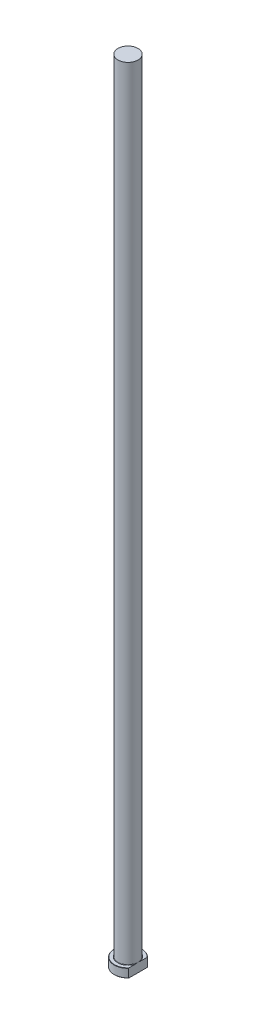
ISO-10303-21;
HEADER;
FILE_DESCRIPTION(('STEP AP214'),'2;1');
FILE_NAME('part.step','',(''),(''),'','','');
FILE_SCHEMA(('AUTOMOTIVE_DESIGN { 1 0 10303 214 1 1 1 1 }'));
ENDSEC;
DATA;
#1=APPLICATION_CONTEXT('core data for automotive mechanical design processes');
#2=APPLICATION_PROTOCOL_DEFINITION('international standard','automotive_design',2000,#1);
#3=PRODUCT_CONTEXT('',#1,'mechanical');
#4=PRODUCT('Part','Part','',(#3));
#5=PRODUCT_RELATED_PRODUCT_CATEGORY('part','',(#4));
#6=PRODUCT_DEFINITION_FORMATION('','',#4);
#7=PRODUCT_DEFINITION_CONTEXT('part definition',#1,'design');
#8=PRODUCT_DEFINITION('design','',#6,#7);
#9=PRODUCT_DEFINITION_SHAPE('','',#8);
#10=(LENGTH_UNIT() NAMED_UNIT(*) SI_UNIT(.MILLI.,.METRE.));
#11=(NAMED_UNIT(*) PLANE_ANGLE_UNIT() SI_UNIT($,.RADIAN.));
#12=(NAMED_UNIT(*) SI_UNIT($,.STERADIAN.) SOLID_ANGLE_UNIT());
#13=UNCERTAINTY_MEASURE_WITH_UNIT(LENGTH_MEASURE(1.E-05),#10,'distance_accuracy_value','');
#14=(GEOMETRIC_REPRESENTATION_CONTEXT(3) GLOBAL_UNCERTAINTY_ASSIGNED_CONTEXT((#13)) GLOBAL_UNIT_ASSIGNED_CONTEXT((#10,
#11,#12)) REPRESENTATION_CONTEXT('',''));
#15=CARTESIAN_POINT('',(0.,0.,0.));
#16=DIRECTION('',(0.,0.,1.));
#17=DIRECTION('',(1.,0.,0.));
#18=AXIS2_PLACEMENT_3D('',#15,#16,#17);
#19=CARTESIAN_POINT('',(0.,0.,0.));
#20=DIRECTION('',(0.,-1.,0.));
#21=DIRECTION('',(0.,0.,-1.));
#22=AXIS2_PLACEMENT_3D('',#19,#20,#21);
#23=PLANE('',#22);
#24=CARTESIAN_POINT('',(0.,0.,0.));
#25=DIRECTION('',(0.,-1.,0.));
#26=DIRECTION('',(0.,0.,-1.));
#27=AXIS2_PLACEMENT_3D('',#24,#25,#26);
#28=CIRCLE('',#27,10.8);
#29=CARTESIAN_POINT('',(7.99999999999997,0.,7.25534285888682));
#30=VERTEX_POINT('',#29);
#31=CARTESIAN_POINT('',(7.99999999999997,0.,-7.25534285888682));
#32=VERTEX_POINT('',#31);
#33=EDGE_CURVE('E98',#30,#32,#28,.T.);
#34=ORIENTED_EDGE('',*,*,#33,.T.);
#35=DIRECTION('',(0.,0.,1.));
#36=VECTOR('',#35,1.);
#37=CARTESIAN_POINT('',(7.99999999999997,0.,-7.54983443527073));
#38=LINE('',#37,#36);
#39=EDGE_CURVE('E83',#32,#30,#38,.T.);
#40=ORIENTED_EDGE('',*,*,#39,.T.);
#41=EDGE_LOOP('',(#34,#40));
#42=FACE_BOUND('',#41,.T.);
#43=ADVANCED_FACE('F32',(#42),#23,.T.);
#44=CARTESIAN_POINT('',(0.,259.958771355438,0.));
#45=DIRECTION('',(0.,1.,0.));
#46=DIRECTION('',(0.,0.,1.));
#47=AXIS2_PLACEMENT_3D('',#44,#45,#46);
#48=CYLINDRICAL_SURFACE('',#47,11.);
#49=CARTESIAN_POINT('',(0.,6.80000000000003,0.));
#50=DIRECTION('',(0.,1.,0.));
#51=DIRECTION('',(0.,0.,1.));
#52=AXIS2_PLACEMENT_3D('',#49,#50,#51);
#53=CIRCLE('',#52,11.);
#54=CARTESIAN_POINT('',(7.99999999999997,6.80000000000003,7.54983443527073));
#55=VERTEX_POINT('',#54);
#56=CARTESIAN_POINT('',(7.99999999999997,6.80000000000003,-7.54983443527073));
#57=VERTEX_POINT('',#56);
#58=EDGE_CURVE('E104',#55,#57,#53,.F.);
#59=ORIENTED_EDGE('',*,*,#58,.T.);
#60=DIRECTION('',(0.,-1.,0.));
#61=VECTOR('',#60,1.);
#62=CARTESIAN_POINT('',(7.99999999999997,630.,-7.54983443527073));
#63=LINE('',#62,#61);
#64=CARTESIAN_POINT('',(7.99999999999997,0.200000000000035,-7.54983443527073));
#65=VERTEX_POINT('',#64);
#66=EDGE_CURVE('E183',#57,#65,#63,.T.);
#67=ORIENTED_EDGE('',*,*,#66,.T.);
#68=CARTESIAN_POINT('',(0.,0.200000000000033,0.));
#69=DIRECTION('',(0.,-1.,0.));
#70=DIRECTION('',(0.,0.,-1.));
#71=AXIS2_PLACEMENT_3D('',#68,#69,#70);
#72=CIRCLE('',#71,11.);
#73=CARTESIAN_POINT('',(7.99999999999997,0.200000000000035,7.54983443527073));
#74=VERTEX_POINT('',#73);
#75=EDGE_CURVE('E100',#65,#74,#72,.F.);
#76=ORIENTED_EDGE('',*,*,#75,.T.);
#77=DIRECTION('',(0.,-1.,0.));
#78=VECTOR('',#77,1.);
#79=CARTESIAN_POINT('',(7.99999999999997,630.,7.54983443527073));
#80=LINE('',#79,#78);
#81=EDGE_CURVE('E93',#55,#74,#80,.T.);
#82=ORIENTED_EDGE('',*,*,#81,.F.);
#83=EDGE_LOOP('',(#59,#67,#76,#82));
#84=FACE_BOUND('',#83,.T.);
#85=ADVANCED_FACE('F158',(#84),#48,.T.);
#86=CARTESIAN_POINT('',(-11.,7.,0.));
#87=DIRECTION('',(0.,1.,0.));
#88=DIRECTION('',(0.,0.,1.));
#89=AXIS2_PLACEMENT_3D('',#86,#87,#88);
#90=PLANE('',#89);
#91=CARTESIAN_POINT('',(0.,7.,0.));
#92=DIRECTION('',(0.,1.,0.));
#93=DIRECTION('',(0.,0.,1.));
#94=AXIS2_PLACEMENT_3D('',#91,#92,#93);
#95=CIRCLE('',#94,10.8);
#96=CARTESIAN_POINT('',(7.99999999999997,7.,-7.25534285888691));
#97=VERTEX_POINT('',#96);
#98=CARTESIAN_POINT('',(7.99999999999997,7.,7.25534285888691));
#99=VERTEX_POINT('',#98);
#100=EDGE_CURVE('E178',#97,#99,#95,.T.);
#101=ORIENTED_EDGE('',*,*,#100,.T.);
#102=DIRECTION('',(0.,0.,-1.));
#103=VECTOR('',#102,1.);
#104=CARTESIAN_POINT('',(7.99999999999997,7.,0.));
#105=LINE('',#104,#103);
#106=CARTESIAN_POINT('',(7.99999999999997,6.99999999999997,2.21133443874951));
#107=VERTEX_POINT('',#106);
#108=EDGE_CURVE('E57',#99,#107,#105,.T.);
#109=ORIENTED_EDGE('',*,*,#108,.T.);
#110=CARTESIAN_POINT('',(0.,7.,0.));
#111=DIRECTION('',(0.,1.,0.));
#112=DIRECTION('',(0.,0.,1.));
#113=AXIS2_PLACEMENT_3D('',#110,#111,#112);
#114=CIRCLE('',#113,8.29999999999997);
#115=CARTESIAN_POINT('',(7.99999999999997,6.99999999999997,-2.21133443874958));
#116=VERTEX_POINT('',#115);
#117=EDGE_CURVE('E107',#107,#116,#114,.F.);
#118=ORIENTED_EDGE('',*,*,#117,.T.);
#119=EDGE_CURVE('E136',#116,#97,#105,.T.);
#120=ORIENTED_EDGE('',*,*,#119,.T.);
#121=EDGE_LOOP('',(#101,#109,#118,#120));
#122=FACE_BOUND('',#121,.T.);
#123=ADVANCED_FACE('F147',(#122),#90,.T.);
#124=CARTESIAN_POINT('',(0.,7.00000000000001,0.));
#125=DIRECTION('',(0.,-1.,0.));
#126=DIRECTION('',(0.,0.,-1.));
#127=AXIS2_PLACEMENT_3D('',#124,#125,#126);
#128=CONICAL_SURFACE('',#127,10.8,0.785398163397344);
#129=ORIENTED_EDGE('',*,*,#58,.F.);
#130=CARTESIAN_POINT('',(7.99999999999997,-0.636730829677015,16.6106304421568));
#131=CARTESIAN_POINT('',(7.99999999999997,-0.418611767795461,16.3685283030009));
#132=CARTESIAN_POINT('',(7.99999999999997,-0.200984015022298,16.1259843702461));
#133=CARTESIAN_POINT('',(7.99999999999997,0.233148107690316,15.639892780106));
#134=CARTESIAN_POINT('',(7.99999999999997,0.449652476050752,15.3963451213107));
#135=CARTESIAN_POINT('',(7.99999999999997,1.09739989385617,14.6638687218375));
#136=CARTESIAN_POINT('',(7.99999999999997,1.52674426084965,14.1732538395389));
#137=CARTESIAN_POINT('',(7.99999999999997,2.16792810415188,13.430465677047));
#138=CARTESIAN_POINT('',(7.99999999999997,2.38226067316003,13.1804430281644));
#139=CARTESIAN_POINT('',(7.99999999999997,2.80892954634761,12.6787083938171));
#140=CARTESIAN_POINT('',(7.99999999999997,3.02126589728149,12.4269964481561));
#141=CARTESIAN_POINT('',(7.99999999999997,3.44357020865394,11.921674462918));
#142=CARTESIAN_POINT('',(7.99999999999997,3.6535386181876,11.6680647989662));
#143=CARTESIAN_POINT('',(7.99999999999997,4.07074862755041,11.1585723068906));
#144=CARTESIAN_POINT('',(7.99999999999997,4.27798998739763,10.9026892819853));
#145=CARTESIAN_POINT('',(7.99999999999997,4.66965190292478,10.4127607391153));
#146=CARTESIAN_POINT('',(7.99999999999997,4.8543686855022,10.178952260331));
#147=CARTESIAN_POINT('',(7.99999999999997,5.22063517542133,9.70886883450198));
#148=CARTESIAN_POINT('',(7.99999999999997,5.40218492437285,9.4725939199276));
#149=CARTESIAN_POINT('',(7.99999999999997,5.76149237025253,8.99721569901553));
#150=CARTESIAN_POINT('',(7.99999999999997,5.93925050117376,8.75811272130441));
#151=CARTESIAN_POINT('',(7.99999999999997,6.29022306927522,8.27660199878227));
#152=CARTESIAN_POINT('',(7.99999999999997,6.46343768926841,8.03419438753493));
#153=CARTESIAN_POINT('',(7.99999999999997,6.80398487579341,7.54604999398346));
#154=CARTESIAN_POINT('',(7.99999999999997,6.97132935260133,7.30032154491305));
#155=CARTESIAN_POINT('',(7.99999999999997,7.29928849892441,6.8043777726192));
#156=CARTESIAN_POINT('',(7.99999999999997,7.4599028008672,6.55416220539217));
#157=CARTESIAN_POINT('',(7.99999999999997,7.77264940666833,6.0487314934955));
#158=CARTESIAN_POINT('',(7.99999999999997,7.92478824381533,5.79352041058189));
#159=CARTESIAN_POINT('',(7.99999999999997,8.21859570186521,5.27715744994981));
#160=CARTESIAN_POINT('',(7.99999999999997,8.36026610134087,5.0160065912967));
#161=CARTESIAN_POINT('',(7.99999999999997,8.62213596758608,4.50319242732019));
#162=CARTESIAN_POINT('',(7.99999999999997,8.74311989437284,4.25193242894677));
#163=CARTESIAN_POINT('',(7.99999999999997,8.97065709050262,3.74287674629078));
#164=CARTESIAN_POINT('',(7.99999999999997,9.07720941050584,3.48508063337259));
#165=CARTESIAN_POINT('',(7.99999999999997,9.27220860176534,2.96337495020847));
#166=CARTESIAN_POINT('',(7.99999999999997,9.36069936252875,2.6994819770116));
#167=CARTESIAN_POINT('',(7.99999999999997,9.5160431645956,2.165427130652));
#168=CARTESIAN_POINT('',(7.99999999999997,9.58290677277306,1.89526838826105));
#169=CARTESIAN_POINT('',(7.99999999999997,9.68291221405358,1.39216000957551));
#170=CARTESIAN_POINT('',(7.99999999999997,9.71967474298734,1.15993430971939));
#171=CARTESIAN_POINT('',(7.99999999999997,9.77336730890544,0.693196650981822));
#172=CARTESIAN_POINT('',(7.99999999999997,9.79030037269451,0.45868504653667));
#173=CARTESIAN_POINT('',(7.99999999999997,9.80342851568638,-0.0106727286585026));
#174=CARTESIAN_POINT('',(7.99999999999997,9.7996460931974,-0.245518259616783));
#175=CARTESIAN_POINT('',(7.99999999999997,9.77160926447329,-0.713989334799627));
#176=CARTESIAN_POINT('',(7.99999999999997,9.74735189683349,-0.947614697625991));
#177=CARTESIAN_POINT('',(7.99999999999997,9.67070830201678,-1.47287443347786));
#178=CARTESIAN_POINT('',(7.99999999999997,9.61261890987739,-1.76367634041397));
#179=CARTESIAN_POINT('',(7.99999999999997,9.46982192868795,-2.33873282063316));
#180=CARTESIAN_POINT('',(7.99999999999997,9.3850975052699,-2.622983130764));
#181=CARTESIAN_POINT('',(7.99999999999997,9.24134311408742,-3.04436856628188));
#182=CARTESIAN_POINT('',(7.99999999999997,9.19048552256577,-3.18437323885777));
#183=CARTESIAN_POINT('',(7.99999999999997,9.08381674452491,-3.46241560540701));
#184=CARTESIAN_POINT('',(7.99999999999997,9.0280078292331,-3.60045416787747));
#185=CARTESIAN_POINT('',(7.99999999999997,8.91195481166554,-3.87463242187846));
#186=CARTESIAN_POINT('',(7.99999999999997,8.85171106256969,-4.01077226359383));
#187=CARTESIAN_POINT('',(7.99999999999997,8.72725899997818,-4.28124317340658));
#188=CARTESIAN_POINT('',(7.99999999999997,8.66305017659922,-4.41557400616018));
#189=CARTESIAN_POINT('',(7.99999999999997,8.48984738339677,-4.76597692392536));
#190=CARTESIAN_POINT('',(7.99999999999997,8.37796178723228,-4.98062176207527));
#191=CARTESIAN_POINT('',(7.99999999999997,8.14649205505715,-5.40573762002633));
#192=CARTESIAN_POINT('',(7.99999999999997,8.02690659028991,-5.61620791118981));
#193=CARTESIAN_POINT('',(7.99999999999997,7.78128707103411,-6.03349586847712));
#194=CARTESIAN_POINT('',(7.99999999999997,7.6552494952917,-6.24031145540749));
#195=CARTESIAN_POINT('',(7.99999999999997,7.39783636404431,-6.65060320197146));
#196=CARTESIAN_POINT('',(7.99999999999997,7.26646042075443,-6.85407911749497));
#197=CARTESIAN_POINT('',(7.99999999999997,6.99890352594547,-7.25856399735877));
#198=CARTESIAN_POINT('',(7.99999999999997,6.86271149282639,-7.45956561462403));
#199=CARTESIAN_POINT('',(7.99999999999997,6.58651908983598,-7.85893907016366));
#200=CARTESIAN_POINT('',(7.99999999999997,6.44651858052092,-8.05731081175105));
#201=CARTESIAN_POINT('',(7.99999999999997,6.02178241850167,-8.64881247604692));
#202=CARTESIAN_POINT('',(7.99999999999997,5.73221467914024,-9.03847436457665));
#203=CARTESIAN_POINT('',(7.99999999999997,5.14234581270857,-9.8121850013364));
#204=CARTESIAN_POINT('',(7.99999999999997,4.84200393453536,-10.1962024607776));
#205=CARTESIAN_POINT('',(7.99999999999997,4.23404813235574,-10.9584616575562));
#206=CARTESIAN_POINT('',(7.99999999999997,3.92643376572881,-11.3367030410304));
#207=CARTESIAN_POINT('',(7.99999999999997,3.30600745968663,-12.0880358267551));
#208=CARTESIAN_POINT('',(7.99999999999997,2.9932030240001,-12.4611334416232));
#209=CARTESIAN_POINT('',(7.99999999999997,2.36317801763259,-13.2035599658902));
#210=CARTESIAN_POINT('',(7.99999999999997,2.04595754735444,-13.5728889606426));
#211=CARTESIAN_POINT('',(7.99999999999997,1.33644011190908,-14.3909378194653));
#212=CARTESIAN_POINT('',(7.99999999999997,0.943258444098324,-14.8388897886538));
#213=CARTESIAN_POINT('',(7.99999999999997,0.351483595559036,-15.506812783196));
#214=CARTESIAN_POINT('',(7.99999999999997,0.154449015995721,-15.7281687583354));
#215=CARTESIAN_POINT('',(7.99999999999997,-0.240498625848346,-16.1700151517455));
#216=CARTESIAN_POINT('',(7.99999999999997,-0.438411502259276,-16.3905057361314));
#217=CARTESIAN_POINT('',(7.99999999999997,-0.636730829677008,-16.6106304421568));
#218=B_SPLINE_CURVE_WITH_KNOTS('',3,(#130,#131,#132,#133,#134,#135,#136,#137,#138,#139,#140,
#141,#142,#143,#144,#145,#146,#147,#148,#149,#150,#151,#152,#153,#154,#155,#156,#157,#158,#159,
#160,#161,#162,#163,#164,#165,#166,#167,#168,#169,#170,#171,#172,#173,#174,#175,#176,#177,#178,
#179,#180,#181,#182,#183,#184,#185,#186,#187,#188,#189,#190,#191,#192,#193,#194,#195,#196,#197,
#198,#199,#200,#201,#202,#203,#204,#205,#206,#207,#208,#209,#210,#211,#212,#213,#214,#215,#216,
#217),.UNSPECIFIED.,.F.,.F.,(4,2,2,2,2,2,2,2,2,2,2,2,2,2,2,2,2,2,2,2,2,2,2,2,2,2,2,2,2,2,2,2,2,
2,2,2,2,2,2,2,2,2,2,4),(0.,0.977598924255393,1.9551992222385,3.91099512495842,4.8989385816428,
5.88685884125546,6.87458847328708,7.86240445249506,8.75629469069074,9.65017317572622,
10.5439487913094,11.4376883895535,12.3294952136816,13.2213506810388,14.112508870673,
15.0035153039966,15.839762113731,16.6760639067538,17.5103086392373,18.3441451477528,
19.0487229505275,19.7531931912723,20.4568984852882,21.1607055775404,22.0488428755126,
22.9375426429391,23.3843335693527,23.8309205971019,24.2774720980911,24.7240811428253,
25.4500411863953,26.1761268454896,26.9026130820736,27.6291521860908,28.3574884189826,
29.0858513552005,30.542052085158,32.0045059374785,33.467049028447,34.927635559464,
36.3881889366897,38.1762452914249,39.0652821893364,39.9541391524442),.UNSPECIFIED.);
#219=EDGE_CURVE('E135',#55,#99,#218,.T.);
#220=ORIENTED_EDGE('',*,*,#219,.T.);
#221=ORIENTED_EDGE('',*,*,#100,.F.);
#222=EDGE_CURVE('E127',#97,#57,#218,.T.);
#223=ORIENTED_EDGE('',*,*,#222,.T.);
#224=EDGE_LOOP('',(#129,#220,#221,#223));
#225=FACE_BOUND('',#224,.T.);
#226=ADVANCED_FACE('F143',(#225),#128,.T.);
#227=CARTESIAN_POINT('',(0.,0.200000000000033,0.));
#228=DIRECTION('',(0.,1.,0.));
#229=DIRECTION('',(0.,0.,1.));
#230=AXIS2_PLACEMENT_3D('',#227,#228,#229);
#231=CONICAL_SURFACE('',#230,11.,0.785398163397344);
#232=ORIENTED_EDGE('',*,*,#75,.F.);
#233=CARTESIAN_POINT('',(7.99999999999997,7.63673082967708,-16.6106304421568));
#234=CARTESIAN_POINT('',(7.99999999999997,7.41861176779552,-16.3685283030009));
#235=CARTESIAN_POINT('',(7.99999999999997,7.20098401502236,-16.1259843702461));
#236=CARTESIAN_POINT('',(7.99999999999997,6.76685189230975,-15.639892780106));
#237=CARTESIAN_POINT('',(7.99999999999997,6.55034752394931,-15.3963451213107));
#238=CARTESIAN_POINT('',(7.99999999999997,5.90260010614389,-14.6638687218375));
#239=CARTESIAN_POINT('',(7.99999999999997,5.47325573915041,-14.1732538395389));
#240=CARTESIAN_POINT('',(7.99999999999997,4.83207189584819,-13.430465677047));
#241=CARTESIAN_POINT('',(7.99999999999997,4.61773932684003,-13.1804430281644));
#242=CARTESIAN_POINT('',(7.99999999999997,4.19107045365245,-12.6787083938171));
#243=CARTESIAN_POINT('',(7.99999999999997,3.97873410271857,-12.4269964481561));
#244=CARTESIAN_POINT('',(7.99999999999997,3.55642979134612,-11.921674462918));
#245=CARTESIAN_POINT('',(7.99999999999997,3.34646138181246,-11.6680647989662));
#246=CARTESIAN_POINT('',(7.99999999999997,2.92925137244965,-11.1585723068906));
#247=CARTESIAN_POINT('',(7.99999999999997,2.72201001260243,-10.9026892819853));
#248=CARTESIAN_POINT('',(7.99999999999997,2.33034809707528,-10.4127607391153));
#249=CARTESIAN_POINT('',(7.99999999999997,2.14563131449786,-10.178952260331));
#250=CARTESIAN_POINT('',(7.99999999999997,1.77936482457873,-9.70886883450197));
#251=CARTESIAN_POINT('',(7.99999999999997,1.59781507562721,-9.4725939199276));
#252=CARTESIAN_POINT('',(7.99999999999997,1.23850762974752,-8.99721569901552));
#253=CARTESIAN_POINT('',(7.99999999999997,1.0607494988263,-8.75811272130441));
#254=CARTESIAN_POINT('',(7.99999999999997,0.709776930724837,-8.27660199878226));
#255=CARTESIAN_POINT('',(7.99999999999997,0.536562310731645,-8.03419438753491));
#256=CARTESIAN_POINT('',(7.99999999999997,0.196015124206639,-7.54604999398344));
#257=CARTESIAN_POINT('',(7.99999999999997,0.0286706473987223,-7.30032154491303));
#258=CARTESIAN_POINT('',(7.99999999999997,-0.299288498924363,-6.80437777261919));
#259=CARTESIAN_POINT('',(7.99999999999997,-0.459902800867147,-6.55416220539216));
#260=CARTESIAN_POINT('',(7.99999999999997,-0.772649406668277,-6.04873149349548));
#261=CARTESIAN_POINT('',(7.99999999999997,-0.924788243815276,-5.79352041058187));
#262=CARTESIAN_POINT('',(7.99999999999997,-1.21859570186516,-5.27715744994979));
#263=CARTESIAN_POINT('',(7.99999999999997,-1.36026610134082,-5.01600659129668));
#264=CARTESIAN_POINT('',(7.99999999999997,-1.62213596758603,-4.50319242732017));
#265=CARTESIAN_POINT('',(7.99999999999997,-1.74311989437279,-4.25193242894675));
#266=CARTESIAN_POINT('',(7.99999999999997,-1.97065709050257,-3.74287674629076));
#267=CARTESIAN_POINT('',(7.99999999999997,-2.07720941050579,-3.48508063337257));
#268=CARTESIAN_POINT('',(7.99999999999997,-2.27220860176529,-2.96337495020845));
#269=CARTESIAN_POINT('',(7.99999999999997,-2.36069936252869,-2.69948197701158));
#270=CARTESIAN_POINT('',(7.99999999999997,-2.51604316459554,-2.16542713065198));
#271=CARTESIAN_POINT('',(7.99999999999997,-2.582906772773,-1.89526838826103));
#272=CARTESIAN_POINT('',(7.99999999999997,-2.68291221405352,-1.39216000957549));
#273=CARTESIAN_POINT('',(7.99999999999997,-2.71967474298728,-1.15993430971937));
#274=CARTESIAN_POINT('',(7.99999999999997,-2.77336730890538,-0.693196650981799));
#275=CARTESIAN_POINT('',(7.99999999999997,-2.79030037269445,-0.458685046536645));
#276=CARTESIAN_POINT('',(7.99999999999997,-2.80342851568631,0.0106727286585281));
#277=CARTESIAN_POINT('',(7.99999999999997,-2.79964609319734,0.245518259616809));
#278=CARTESIAN_POINT('',(7.99999999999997,-2.77160926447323,0.713989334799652));
#279=CARTESIAN_POINT('',(7.99999999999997,-2.74735189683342,0.947614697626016));
#280=CARTESIAN_POINT('',(7.99999999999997,-2.67070830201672,1.47287443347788));
#281=CARTESIAN_POINT('',(7.99999999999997,-2.61261890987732,1.76367634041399));
#282=CARTESIAN_POINT('',(7.99999999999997,-2.46982192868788,2.33873282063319));
#283=CARTESIAN_POINT('',(7.99999999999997,-2.38509750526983,2.62298313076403));
#284=CARTESIAN_POINT('',(7.99999999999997,-2.24134311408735,3.04436856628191));
#285=CARTESIAN_POINT('',(7.99999999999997,-2.1904855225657,3.1843732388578));
#286=CARTESIAN_POINT('',(7.99999999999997,-2.08381674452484,3.46241560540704));
#287=CARTESIAN_POINT('',(7.99999999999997,-2.02800782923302,3.6004541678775));
#288=CARTESIAN_POINT('',(7.99999999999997,-1.91195481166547,3.87463242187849));
#289=CARTESIAN_POINT('',(7.99999999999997,-1.85171106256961,4.01077226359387));
#290=CARTESIAN_POINT('',(7.99999999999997,-1.72725899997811,4.28124317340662));
#291=CARTESIAN_POINT('',(7.99999999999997,-1.66305017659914,4.41557400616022));
#292=CARTESIAN_POINT('',(7.99999999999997,-1.48984738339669,4.7659769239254));
#293=CARTESIAN_POINT('',(7.99999999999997,-1.37796178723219,4.98062176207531));
#294=CARTESIAN_POINT('',(7.99999999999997,-1.14649205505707,5.40573762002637));
#295=CARTESIAN_POINT('',(7.99999999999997,-1.02690659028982,5.61620791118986));
#296=CARTESIAN_POINT('',(7.99999999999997,-0.781287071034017,6.03349586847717));
#297=CARTESIAN_POINT('',(7.99999999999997,-0.655249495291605,6.24031145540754));
#298=CARTESIAN_POINT('',(7.99999999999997,-0.397836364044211,6.65060320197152));
#299=CARTESIAN_POINT('',(7.99999999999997,-0.266460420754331,6.85407911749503));
#300=CARTESIAN_POINT('',(7.99999999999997,0.00109647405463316,7.25856399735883));
#301=CARTESIAN_POINT('',(7.99999999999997,0.137288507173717,7.4595656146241));
#302=CARTESIAN_POINT('',(7.99999999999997,0.413480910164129,7.85893907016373));
#303=CARTESIAN_POINT('',(7.99999999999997,0.553481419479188,8.05731081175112));
#304=CARTESIAN_POINT('',(7.99999999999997,0.978217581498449,8.64881247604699));
#305=CARTESIAN_POINT('',(7.99999999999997,1.26778532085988,9.03847436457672));
#306=CARTESIAN_POINT('',(7.99999999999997,1.85765418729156,9.81218500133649));
#307=CARTESIAN_POINT('',(7.99999999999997,2.15799606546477,10.1962024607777));
#308=CARTESIAN_POINT('',(7.99999999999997,2.7659518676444,10.9584616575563));
#309=CARTESIAN_POINT('',(7.99999999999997,3.07356623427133,11.3367030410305));
#310=CARTESIAN_POINT('',(7.99999999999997,3.69399254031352,12.0880358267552));
#311=CARTESIAN_POINT('',(7.99999999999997,4.00679697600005,12.4611334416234));
#312=CARTESIAN_POINT('',(7.99999999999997,4.63682198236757,13.2035599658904));
#313=CARTESIAN_POINT('',(7.99999999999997,4.95404245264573,13.5728889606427));
#314=CARTESIAN_POINT('',(7.99999999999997,5.66355988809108,14.3909378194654));
#315=CARTESIAN_POINT('',(7.99999999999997,6.05674155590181,14.8388897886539));
#316=CARTESIAN_POINT('',(7.99999999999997,6.64851640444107,15.506812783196));
#317=CARTESIAN_POINT('',(7.99999999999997,6.84555098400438,15.7281687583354));
#318=CARTESIAN_POINT('',(7.99999999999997,7.24049862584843,16.1700151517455));
#319=CARTESIAN_POINT('',(7.99999999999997,7.43841150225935,16.3905057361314));
#320=CARTESIAN_POINT('',(7.99999999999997,7.63673082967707,16.6106304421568));
#321=B_SPLINE_CURVE_WITH_KNOTS('',3,(#233,#234,#235,#236,#237,#238,#239,#240,#241,#242,#243,
#244,#245,#246,#247,#248,#249,#250,#251,#252,#253,#254,#255,#256,#257,#258,#259,#260,#261,#262,
#263,#264,#265,#266,#267,#268,#269,#270,#271,#272,#273,#274,#275,#276,#277,#278,#279,#280,#281,
#282,#283,#284,#285,#286,#287,#288,#289,#290,#291,#292,#293,#294,#295,#296,#297,#298,#299,#300,
#301,#302,#303,#304,#305,#306,#307,#308,#309,#310,#311,#312,#313,#314,#315,#316,#317,#318,#319,
#320),.UNSPECIFIED.,.F.,.F.,(4,2,2,2,2,2,2,2,2,2,2,2,2,2,2,2,2,2,2,2,2,2,2,2,2,2,2,2,2,2,2,2,2,
2,2,2,2,2,2,2,2,2,2,4),(0.,0.977598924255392,1.9551992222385,3.91099512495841,4.8989385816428,
5.88685884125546,6.87458847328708,7.86240445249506,8.75629469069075,9.65017317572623,
10.5439487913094,11.4376883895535,12.3294952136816,13.2213506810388,14.112508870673,
15.0035153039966,15.8397621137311,16.6760639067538,17.5103086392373,18.3441451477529,
19.0487229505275,19.7531931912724,20.4568984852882,21.1607055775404,22.0488428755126,
22.9375426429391,23.3843335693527,23.830920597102,24.2774720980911,24.7240811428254,
25.4500411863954,26.1761268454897,26.9026130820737,27.6291521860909,28.3574884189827,
29.0858513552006,30.5420520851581,32.0045059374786,33.4670490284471,34.9276355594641,
36.3881889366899,38.176245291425,39.0652821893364,39.9541391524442),.UNSPECIFIED.);
#322=EDGE_CURVE('E86',#65,#32,#321,.T.);
#323=ORIENTED_EDGE('',*,*,#322,.T.);
#324=ORIENTED_EDGE('',*,*,#33,.F.);
#325=EDGE_CURVE('E89',#30,#74,#321,.T.);
#326=ORIENTED_EDGE('',*,*,#325,.T.);
#327=EDGE_LOOP('',(#232,#323,#324,#326));
#328=FACE_BOUND('',#327,.T.);
#329=ADVANCED_FACE('F97',(#328),#231,.T.);
#330=CARTESIAN_POINT('',(0.,7.29999999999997,0.));
#331=DIRECTION('',(0.,1.,0.));
#332=DIRECTION('',(0.,0.,1.));
#333=AXIS2_PLACEMENT_3D('',#330,#331,#332);
#334=TOROIDAL_SURFACE('',#333,8.29999999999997,0.3);
#335=CARTESIAN_POINT('',(7.99999999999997,7.29999999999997,0.));
#336=CARTESIAN_POINT('',(7.99999999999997,7.30000062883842,1.41343368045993E-10));
#337=CARTESIAN_POINT('',(7.99999999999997,7.30000125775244,-3.45355322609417E-07));
#338=CARTESIAN_POINT('',(7.99999999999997,7.30000241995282,-1.23398463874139E-06));
#339=CARTESIAN_POINT('',(7.99999999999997,7.30000291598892,-1.80141989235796E-06));
#340=CARTESIAN_POINT('',(7.99999999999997,7.30000399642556,-3.18390842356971E-06));
#341=CARTESIAN_POINT('',(7.99999999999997,7.30000456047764,-4.02115832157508E-06));
#342=CARTESIAN_POINT('',(7.99999999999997,7.30000552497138,-5.71072460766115E-06));
#343=CARTESIAN_POINT('',(7.99999999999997,7.30000593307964,-6.55926444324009E-06));
#344=CARTESIAN_POINT('',(7.99999999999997,7.30000755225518,-1.000964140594E-05));
#345=CARTESIAN_POINT('',(7.99999999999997,7.30000869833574,-1.26477244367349E-05));
#346=CARTESIAN_POINT('',(7.99999999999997,7.30001047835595,-1.77422280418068E-05));
#347=CARTESIAN_POINT('',(7.99999999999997,7.30001115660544,-2.01836505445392E-05));
#348=CARTESIAN_POINT('',(7.99999999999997,7.30001417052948,-3.09435594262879E-05));
#349=CARTESIAN_POINT('',(7.99999999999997,7.30001656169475,-3.92473415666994E-05));
#350=CARTESIAN_POINT('',(7.99999999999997,7.30001991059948,-5.46311733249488E-05));
#351=CARTESIAN_POINT('',(7.99999999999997,7.30002104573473,-6.16717033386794E-05));
#352=CARTESIAN_POINT('',(7.99999999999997,7.30002955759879,-0.000115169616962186));
#353=CARTESIAN_POINT('',(7.99999999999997,7.30003630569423,-0.000161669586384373));
#354=CARTESIAN_POINT('',(7.99999999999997,7.30006581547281,-0.00034712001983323));
#355=CARTESIAN_POINT('',(7.99999999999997,7.30009364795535,-0.000485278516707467));
#356=CARTESIAN_POINT('',(7.99999999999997,7.30020325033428,-0.00103711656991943));
#357=CARTESIAN_POINT('',(7.99999999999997,7.30028197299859,-0.00145117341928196));
#358=CARTESIAN_POINT('',(7.99999999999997,7.30059973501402,-0.00311182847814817));
#359=CARTESIAN_POINT('',(7.99999999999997,7.30084275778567,-0.00435790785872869));
#360=CARTESIAN_POINT('',(7.99999999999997,7.30186073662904,-0.00958966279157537));
#361=CARTESIAN_POINT('',(7.99999999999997,7.30263061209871,-0.0135760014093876));
#362=CARTESIAN_POINT('',(7.99999999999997,7.30870312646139,-0.0450030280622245));
#363=CARTESIAN_POINT('',(7.99999999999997,7.31402334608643,-0.0724414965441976));
#364=CARTESIAN_POINT('',(7.99999999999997,7.32442239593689,-0.126197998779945));
#365=CARTESIAN_POINT('',(7.99999999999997,7.32950218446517,-0.152515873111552));
#366=CARTESIAN_POINT('',(7.99999999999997,7.34609783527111,-0.23868034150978));
#367=CARTESIAN_POINT('',(7.99999999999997,7.35757011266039,-0.29853557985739));
#368=CARTESIAN_POINT('',(7.99999999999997,7.37688511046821,-0.400403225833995));
#369=CARTESIAN_POINT('',(7.99999999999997,7.38478827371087,-0.442404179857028));
#370=CARTESIAN_POINT('',(7.99999999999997,7.40022249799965,-0.525284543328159));
#371=CARTESIAN_POINT('',(7.99999999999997,7.40775782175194,-0.566163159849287));
#372=CARTESIAN_POINT('',(7.99999999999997,7.4322438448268,-0.700743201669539));
#373=CARTESIAN_POINT('',(7.99999999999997,7.44879297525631,-0.794518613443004));
#374=CARTESIAN_POINT('',(7.99999999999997,7.48053424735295,-0.983225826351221));
#375=CARTESIAN_POINT('',(7.99999999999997,7.49571186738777,-1.07816009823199));
#376=CARTESIAN_POINT('',(7.99999999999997,7.52532008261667,-1.27781321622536));
#377=CARTESIAN_POINT('',(7.99999999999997,7.53952614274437,-1.38256589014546));
#378=CARTESIAN_POINT('',(7.99999999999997,7.564310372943,-1.59223320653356));
#379=CARTESIAN_POINT('',(7.99999999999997,7.57489817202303,-1.6971466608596));
#380=CARTESIAN_POINT('',(7.99999999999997,7.58780012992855,-1.86417161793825));
#381=CARTESIAN_POINT('',(7.99999999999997,7.59172630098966,-1.92615747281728));
#382=CARTESIAN_POINT('',(7.99999999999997,7.59748111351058,-2.05022364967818));
#383=CARTESIAN_POINT('',(7.99999999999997,7.59931001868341,-2.11230395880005));
#384=CARTESIAN_POINT('',(7.99999999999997,7.60036180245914,-2.23528941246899));
#385=CARTESIAN_POINT('',(7.99999999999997,7.59963462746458,-2.29619395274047));
#386=CARTESIAN_POINT('',(7.99999999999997,7.59500883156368,-2.41785147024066));
#387=CARTESIAN_POINT('',(7.99999999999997,7.59111224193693,-2.47860451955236));
#388=CARTESIAN_POINT('',(7.99999999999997,7.57906933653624,-2.60042626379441));
#389=CARTESIAN_POINT('',(7.99999999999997,7.570876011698,-2.66149089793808));
#390=CARTESIAN_POINT('',(7.99999999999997,7.55390997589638,-2.7523359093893));
#391=CARTESIAN_POINT('',(7.99999999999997,7.54745990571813,-2.78254437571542));
#392=CARTESIAN_POINT('',(7.99999999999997,7.5325641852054,-2.84244543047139));
#393=CARTESIAN_POINT('',(7.99999999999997,7.52412026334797,-2.87213844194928));
#394=CARTESIAN_POINT('',(7.99999999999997,7.50454333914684,-2.93081083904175));
#395=CARTESIAN_POINT('',(7.99999999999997,7.4933995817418,-2.95978684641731));
#396=CARTESIAN_POINT('',(7.99999999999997,7.47379430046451,-3.00191342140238));
#397=CARTESIAN_POINT('',(7.99999999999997,7.46677809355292,-3.01573193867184));
#398=CARTESIAN_POINT('',(7.99999999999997,7.45153430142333,-3.04267574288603));
#399=CARTESIAN_POINT('',(7.99999999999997,7.44330842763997,-3.05580197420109));
#400=CARTESIAN_POINT('',(7.99999999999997,7.42520334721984,-3.0811225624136));
#401=CARTESIAN_POINT('',(7.99999999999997,7.41530529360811,-3.09330368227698));
#402=CARTESIAN_POINT('',(7.99999999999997,7.39348961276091,-3.11567039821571));
#403=CARTESIAN_POINT('',(7.99999999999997,7.38158911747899,-3.12587146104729));
#404=CARTESIAN_POINT('',(7.99999999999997,7.3626809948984,-3.13802739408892));
#405=CARTESIAN_POINT('',(7.99999999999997,7.35660667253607,-3.14142291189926));
#406=CARTESIAN_POINT('',(7.99999999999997,7.34401523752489,-3.14727797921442));
#407=CARTESIAN_POINT('',(7.99999999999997,7.33749832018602,-3.14973793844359));
#408=CARTESIAN_POINT('',(7.99999999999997,7.32406766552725,-3.15352036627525));
#409=CARTESIAN_POINT('',(7.99999999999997,7.31715078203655,-3.15483196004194));
#410=CARTESIAN_POINT('',(7.99999999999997,7.30319454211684,-3.15612126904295));
#411=CARTESIAN_POINT('',(7.99999999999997,7.29615528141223,-3.15609998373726));
#412=CARTESIAN_POINT('',(7.99999999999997,7.28287791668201,-3.15479583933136));
#413=CARTESIAN_POINT('',(7.99999999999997,7.27662738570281,-3.15363338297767));
#414=CARTESIAN_POINT('',(7.99999999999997,7.26438977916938,-3.15033645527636));
#415=CARTESIAN_POINT('',(7.99999999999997,7.25840290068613,-3.14820126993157));
#416=CARTESIAN_POINT('',(7.99999999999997,7.24428488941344,-3.14202752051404));
#417=CARTESIAN_POINT('',(7.99999999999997,7.2363403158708,-3.13756526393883));
#418=CARTESIAN_POINT('',(7.99999999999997,7.22124755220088,-3.1274544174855));
#419=CARTESIAN_POINT('',(7.99999999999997,7.21410153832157,-3.12180270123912));
#420=CARTESIAN_POINT('',(7.99999999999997,7.19559955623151,-3.10524942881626));
#421=CARTESIAN_POINT('',(7.99999999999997,7.18498382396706,-3.09352989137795));
#422=CARTESIAN_POINT('',(7.99999999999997,7.16550497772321,-3.068745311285));
#423=CARTESIAN_POINT('',(7.99999999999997,7.15664572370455,-3.05567739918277));
#424=CARTESIAN_POINT('',(7.99999999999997,7.13735489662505,-3.02391619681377));
#425=CARTESIAN_POINT('',(7.99999999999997,7.12749252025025,-3.00488123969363));
#426=CARTESIAN_POINT('',(7.99999999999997,7.10958189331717,-2.96596235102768));
#427=CARTESIAN_POINT('',(7.99999999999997,7.10153733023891,-2.9460767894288));
#428=CARTESIAN_POINT('',(7.99999999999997,7.08679055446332,-2.90559744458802));
#429=CARTESIAN_POINT('',(7.99999999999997,7.08010240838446,-2.88499860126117));
#430=CARTESIAN_POINT('',(7.99999999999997,7.06789000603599,-2.84348873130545));
#431=CARTESIAN_POINT('',(7.99999999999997,7.06236453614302,-2.8225780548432));
#432=CARTESIAN_POINT('',(7.99999999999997,7.04913807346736,-2.76752236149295));
#433=CARTESIAN_POINT('',(7.99999999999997,7.04220598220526,-2.73319311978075));
#434=CARTESIAN_POINT('',(7.99999999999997,7.0302605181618,-2.66419726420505));
#435=CARTESIAN_POINT('',(7.99999999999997,7.02524820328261,-2.62953047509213));
#436=CARTESIAN_POINT('',(7.99999999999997,7.0124950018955,-2.52504816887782));
#437=CARTESIAN_POINT('',(7.99999999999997,7.00708017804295,-2.45494936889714));
#438=CARTESIAN_POINT('',(7.99999999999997,7.000733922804,-2.31725135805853));
#439=CARTESIAN_POINT('',(7.99999999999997,6.99964073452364,-2.24965783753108));
#440=CARTESIAN_POINT('',(7.99999999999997,7.00055672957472,-2.11488194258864));
#441=CARTESIAN_POINT('',(7.99999999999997,7.00254831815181,-2.04769941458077));
#442=CARTESIAN_POINT('',(7.99999999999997,7.00911662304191,-1.91019632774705));
#443=CARTESIAN_POINT('',(7.99999999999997,7.01381425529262,-1.83988191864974));
#444=CARTESIAN_POINT('',(7.99999999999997,7.02534418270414,-1.69947139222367));
#445=CARTESIAN_POINT('',(7.99999999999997,7.0321753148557,-1.62937517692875));
#446=CARTESIAN_POINT('',(7.99999999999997,7.04774659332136,-1.48770318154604));
#447=CARTESIAN_POINT('',(7.99999999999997,7.05652844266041,-1.41613205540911));
#448=CARTESIAN_POINT('',(7.99999999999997,7.0755719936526,-1.2729917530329));
#449=CARTESIAN_POINT('',(7.99999999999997,7.08583764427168,-1.20142310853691));
#450=CARTESIAN_POINT('',(7.99999999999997,7.11167035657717,-1.03117663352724));
#451=CARTESIAN_POINT('',(7.99999999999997,7.12776522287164,-0.932579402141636));
#452=CARTESIAN_POINT('',(7.99999999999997,7.16130143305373,-0.736797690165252));
#453=CARTESIAN_POINT('',(7.99999999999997,7.1787249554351,-0.639610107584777));
#454=CARTESIAN_POINT('',(7.99999999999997,7.21241690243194,-0.456833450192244));
#455=CARTESIAN_POINT('',(7.99999999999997,7.22858010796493,-0.37122483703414));
#456=CARTESIAN_POINT('',(7.99999999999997,7.25353789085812,-0.240583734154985));
#457=CARTESIAN_POINT('',(7.99999999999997,7.26219901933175,-0.195525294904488));
#458=CARTESIAN_POINT('',(7.99999999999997,7.27945035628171,-0.106166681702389));
#459=CARTESIAN_POINT('',(7.99999999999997,7.28803936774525,-0.0618662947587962));
#460=CARTESIAN_POINT('',(7.99999999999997,7.29737150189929,-0.0135646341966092));
#461=CARTESIAN_POINT('',(7.99999999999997,7.29814363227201,-0.0095669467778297));
#462=CARTESIAN_POINT('',(7.99999999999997,7.29916212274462,-0.0043326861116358));
#463=CARTESIAN_POINT('',(7.99999999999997,7.29940341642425,-0.003095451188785));
#464=CARTESIAN_POINT('',(7.99999999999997,7.29971907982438,-0.00144576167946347));
#465=CARTESIAN_POINT('',(7.99999999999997,7.29979739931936,-0.00103382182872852));
#466=CARTESIAN_POINT('',(7.99999999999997,7.29990652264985,-0.000484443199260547));
#467=CARTESIAN_POINT('',(7.99999999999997,7.29993429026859,-0.000346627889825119));
#468=CARTESIAN_POINT('',(7.99999999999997,7.2999637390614,-0.000161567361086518));
#469=CARTESIAN_POINT('',(7.99999999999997,7.29997047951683,-0.000115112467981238));
#470=CARTESIAN_POINT('',(7.99999999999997,7.29997897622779,-6.16610384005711E-05));
#471=CARTESIAN_POINT('',(7.99999999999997,7.29998010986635,-5.46227082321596E-05));
#472=CARTESIAN_POINT('',(7.99999999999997,7.299983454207,-3.92436766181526E-05));
#473=CARTESIAN_POINT('',(7.99999999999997,7.2999858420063,-3.09423877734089E-05));
#474=CARTESIAN_POINT('',(7.99999999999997,7.29998885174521,-2.01851368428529E-05));
#475=CARTESIAN_POINT('',(7.99999999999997,7.29998952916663,-1.7743877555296E-05));
#476=CARTESIAN_POINT('',(7.99999999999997,7.29999130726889,-1.26495938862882E-05));
#477=CARTESIAN_POINT('',(7.99999999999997,7.29999245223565,-1.00115437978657E-05));
#478=CARTESIAN_POINT('',(7.99999999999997,7.29999406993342,-6.56108535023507E-06));
#479=CARTESIAN_POINT('',(7.99999999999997,7.29999447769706,-5.71247448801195E-06));
#480=CARTESIAN_POINT('',(7.99999999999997,7.29999544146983,-4.02270412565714E-06));
#481=CARTESIAN_POINT('',(7.99999999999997,7.2999960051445,-3.18531707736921E-06));
#482=CARTESIAN_POINT('',(7.99999999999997,7.29999708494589,-1.80252014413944E-06));
#483=CARTESIAN_POINT('',(7.99999999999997,7.29999758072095,-1.23492752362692E-06));
#484=CARTESIAN_POINT('',(7.99999999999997,7.29999874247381,-3.45879353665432E-07));
#485=CARTESIAN_POINT('',(7.99999999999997,7.29999937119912,-1.41334918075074E-10));
#486=CARTESIAN_POINT('',(7.99999999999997,7.29999999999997,0.));
#487=B_SPLINE_CURVE_WITH_KNOTS('',3,(#335,#336,#337,#338,#339,#340,#341,#342,#343,#344,#345,
#346,#347,#348,#349,#350,#351,#352,#353,#354,#355,#356,#357,#358,#359,#360,#361,#362,#363,#364,
#365,#366,#367,#368,#369,#370,#371,#372,#373,#374,#375,#376,#377,#378,#379,#380,#381,#382,#383,
#384,#385,#386,#387,#388,#389,#390,#391,#392,#393,#394,#395,#396,#397,#398,#399,#400,#401,#402,
#403,#404,#405,#406,#407,#408,#409,#410,#411,#412,#413,#414,#415,#416,#417,#418,#419,#420,#421,
#422,#423,#424,#425,#426,#427,#428,#429,#430,#431,#432,#433,#434,#435,#436,#437,#438,#439,#440,
#441,#442,#443,#444,#445,#446,#447,#448,#449,#450,#451,#452,#453,#454,#455,#456,#457,#458,#459,
#460,#461,#462,#463,#464,#465,#466,#467,#468,#469,#470,#471,#472,#473,#474,#475,#476,#477,#478,
#479,#480,#481,#482,#483,#484,#485,#486),.UNSPECIFIED.,.T.,.F.,(4,2,2,2,2,2,2,2,2,2,2,2,2,2,2,2,
2,2,2,2,2,2,2,2,2,2,2,2,2,2,2,2,2,2,2,2,2,2,2,2,2,2,2,2,2,2,2,2,2,2,2,2,2,2,2,2,2,2,2,2,2,2,2,2,
2,2,2,2,2,2,2,2,2,2,2,4),(0.,1.9430465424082E-06,4.23378863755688E-06,7.23541659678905E-06,
1.00606572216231E-05,1.86645549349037E-05,2.62590397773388E-05,5.21541728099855E-05,
7.352737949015E-05,0.000214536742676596,0.000637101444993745,0.00190178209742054,
0.00571013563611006,0.0178905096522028,0.101737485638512,0.182148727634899,0.364982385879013,
0.493196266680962,0.617898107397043,0.903563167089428,1.19196538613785,1.50905932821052,
1.82530271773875,2.01160528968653,2.19788443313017,2.38054404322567,2.56308667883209,
2.74766944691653,2.84028504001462,2.93282063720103,3.02573110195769,3.07218090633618,
3.11856561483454,3.1655130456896,3.21207753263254,3.23289308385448,3.25369950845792,
3.27470089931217,3.29568654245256,3.31467256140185,3.33367253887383,3.36085270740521,
3.38810522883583,3.43527567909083,3.48254866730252,3.54671214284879,3.61100462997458,
3.67593313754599,3.74079353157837,3.8457803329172,3.95082490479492,4.16152093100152,
4.36425153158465,4.56583006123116,4.77720385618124,4.98846262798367,5.20476776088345,
5.42165954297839,5.72134671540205,6.01755113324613,6.27891230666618,6.41656286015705,
6.55193629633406,6.56415137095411,6.56793269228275,6.5691909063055,6.56961242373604,
6.56975329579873,6.56977466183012,6.5698005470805,6.56980814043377,6.56981674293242,
6.56981956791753,6.56982256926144,6.56982485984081,6.56982680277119),.UNSPECIFIED.);
#488=CARTESIAN_POINT('',(7.99999999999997,7.29999999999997,0.));
#489=VERTEX_POINT('',#488);
#490=EDGE_CURVE('E11',#116,#489,#487,.T.);
#491=ORIENTED_EDGE('',*,*,#490,.F.);
#492=ORIENTED_EDGE('',*,*,#117,.F.);
#493=CARTESIAN_POINT('',(7.99999999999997,7.29999999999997,0.));
#494=CARTESIAN_POINT('',(7.99999999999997,7.29999937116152,-1.41343611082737E-10));
#495=CARTESIAN_POINT('',(7.99999999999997,7.29999874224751,3.45355322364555E-07));
#496=CARTESIAN_POINT('',(7.99999999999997,7.29999758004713,1.23398463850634E-06));
#497=CARTESIAN_POINT('',(7.99999999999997,7.29999708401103,1.80141989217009E-06));
#498=CARTESIAN_POINT('',(7.99999999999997,7.29999600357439,3.18390842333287E-06));
#499=CARTESIAN_POINT('',(7.99999999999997,7.29999543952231,4.0211583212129E-06));
#500=CARTESIAN_POINT('',(7.99999999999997,7.29999447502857,5.71072460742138E-06));
#501=CARTESIAN_POINT('',(7.99999999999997,7.2999940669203,6.55926444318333E-06));
#502=CARTESIAN_POINT('',(7.99999999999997,7.29999244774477,1.00096414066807E-05));
#503=CARTESIAN_POINT('',(7.99999999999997,7.2999913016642,1.26477244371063E-05));
#504=CARTESIAN_POINT('',(7.99999999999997,7.29998952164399,1.77422280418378E-05));
#505=CARTESIAN_POINT('',(7.99999999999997,7.2999888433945,2.01836505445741E-05));
#506=CARTESIAN_POINT('',(7.99999999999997,7.29998582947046,3.09435594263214E-05));
#507=CARTESIAN_POINT('',(7.99999999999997,7.29998343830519,3.92473415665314E-05));
#508=CARTESIAN_POINT('',(7.99999999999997,7.29998008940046,5.46311733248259E-05));
#509=CARTESIAN_POINT('',(7.99999999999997,7.29997895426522,6.16717033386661E-05));
#510=CARTESIAN_POINT('',(7.99999999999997,7.29997044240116,0.000115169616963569));
#511=CARTESIAN_POINT('',(7.99999999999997,7.29996369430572,0.000161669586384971));
#512=CARTESIAN_POINT('',(7.99999999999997,7.29993418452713,0.000347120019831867));
#513=CARTESIAN_POINT('',(7.99999999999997,7.2999063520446,0.000485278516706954));
#514=CARTESIAN_POINT('',(7.99999999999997,7.29979674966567,0.00103711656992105));
#515=CARTESIAN_POINT('',(7.99999999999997,7.29971802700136,0.00145117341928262));
#516=CARTESIAN_POINT('',(7.99999999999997,7.29940026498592,0.00311182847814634));
#517=CARTESIAN_POINT('',(7.99999999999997,7.29915724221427,0.00435790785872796));
#518=CARTESIAN_POINT('',(7.99999999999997,7.29813926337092,0.00958966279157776));
#519=CARTESIAN_POINT('',(7.99999999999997,7.29736938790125,0.0135760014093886));
#520=CARTESIAN_POINT('',(7.99999999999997,7.29129687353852,0.0450030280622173));
#521=CARTESIAN_POINT('',(7.99999999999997,7.28597665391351,0.0724414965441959));
#522=CARTESIAN_POINT('',(7.99999999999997,7.27557760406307,0.126197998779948));
#523=CARTESIAN_POINT('',(7.99999999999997,7.27049781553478,0.152515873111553));
#524=CARTESIAN_POINT('',(7.99999999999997,7.25390216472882,0.238680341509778));
#525=CARTESIAN_POINT('',(7.99999999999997,7.24242988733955,0.29853557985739));
#526=CARTESIAN_POINT('',(7.99999999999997,7.22311488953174,0.400403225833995));
#527=CARTESIAN_POINT('',(7.99999999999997,7.21521172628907,0.442404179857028));
#528=CARTESIAN_POINT('',(7.99999999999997,7.19977750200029,0.525284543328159));
#529=CARTESIAN_POINT('',(7.99999999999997,7.192242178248,0.566163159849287));
#530=CARTESIAN_POINT('',(7.99999999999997,7.16775615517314,0.700743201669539));
#531=CARTESIAN_POINT('',(7.99999999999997,7.15120702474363,0.794518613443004));
#532=CARTESIAN_POINT('',(7.99999999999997,7.119465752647,0.983225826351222));
#533=CARTESIAN_POINT('',(7.99999999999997,7.10428813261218,1.07816009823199));
#534=CARTESIAN_POINT('',(7.99999999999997,7.07467991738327,1.27781321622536));
#535=CARTESIAN_POINT('',(7.99999999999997,7.06047385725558,1.38256589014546));
#536=CARTESIAN_POINT('',(7.99999999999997,7.03568962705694,1.59223320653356));
#537=CARTESIAN_POINT('',(7.99999999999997,7.02510182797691,1.6971466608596));
#538=CARTESIAN_POINT('',(7.99999999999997,7.0121998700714,1.86417161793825));
#539=CARTESIAN_POINT('',(7.99999999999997,7.00827369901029,1.92615747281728));
#540=CARTESIAN_POINT('',(7.99999999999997,7.00251888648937,2.05022364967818));
#541=CARTESIAN_POINT('',(7.99999999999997,7.00068998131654,2.11230395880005));
#542=CARTESIAN_POINT('',(7.99999999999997,6.99963819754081,2.23528941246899));
#543=CARTESIAN_POINT('',(7.99999999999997,7.00036537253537,2.29619395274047));
#544=CARTESIAN_POINT('',(7.99999999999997,7.00499116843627,2.41785147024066));
#545=CARTESIAN_POINT('',(7.99999999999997,7.00888775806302,2.47860451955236));
#546=CARTESIAN_POINT('',(7.99999999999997,7.0209306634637,2.60042626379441));
#547=CARTESIAN_POINT('',(7.99999999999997,7.02912398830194,2.66149089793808));
#548=CARTESIAN_POINT('',(7.99999999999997,7.04609002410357,2.7523359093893));
#549=CARTESIAN_POINT('',(7.99999999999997,7.05254009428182,2.78254437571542));
#550=CARTESIAN_POINT('',(7.99999999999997,7.06743581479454,2.84244543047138));
#551=CARTESIAN_POINT('',(7.99999999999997,7.07587973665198,2.87213844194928));
#552=CARTESIAN_POINT('',(7.99999999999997,7.09545666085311,2.93081083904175));
#553=CARTESIAN_POINT('',(7.99999999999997,7.10660041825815,2.95978684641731));
#554=CARTESIAN_POINT('',(7.99999999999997,7.12620569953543,3.00191342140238));
#555=CARTESIAN_POINT('',(7.99999999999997,7.13322190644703,3.01573193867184));
#556=CARTESIAN_POINT('',(7.99999999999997,7.14846569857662,3.04267574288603));
#557=CARTESIAN_POINT('',(7.99999999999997,7.15669157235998,3.05580197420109));
#558=CARTESIAN_POINT('',(7.99999999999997,7.17479665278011,3.0811225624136));
#559=CARTESIAN_POINT('',(7.99999999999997,7.18469470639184,3.09330368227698));
#560=CARTESIAN_POINT('',(7.99999999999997,7.20651038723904,3.11567039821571));
#561=CARTESIAN_POINT('',(7.99999999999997,7.21841088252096,3.12587146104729));
#562=CARTESIAN_POINT('',(7.99999999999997,7.23731900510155,3.13802739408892));
#563=CARTESIAN_POINT('',(7.99999999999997,7.24339332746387,3.14142291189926));
#564=CARTESIAN_POINT('',(7.99999999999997,7.25598476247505,3.14727797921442));
#565=CARTESIAN_POINT('',(7.99999999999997,7.26250167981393,3.14973793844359));
#566=CARTESIAN_POINT('',(7.99999999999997,7.2759323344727,3.15352036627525));
#567=CARTESIAN_POINT('',(7.99999999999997,7.2828492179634,3.15483196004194));
#568=CARTESIAN_POINT('',(7.99999999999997,7.2968054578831,3.15612126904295));
#569=CARTESIAN_POINT('',(7.99999999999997,7.30384471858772,3.15609998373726));
#570=CARTESIAN_POINT('',(7.99999999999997,7.31712208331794,3.15479583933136));
#571=CARTESIAN_POINT('',(7.99999999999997,7.32337261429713,3.15363338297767));
#572=CARTESIAN_POINT('',(7.99999999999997,7.33561022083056,3.15033645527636));
#573=CARTESIAN_POINT('',(7.99999999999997,7.34159709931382,3.14820126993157));
#574=CARTESIAN_POINT('',(7.99999999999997,7.3557151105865,3.14202752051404));
#575=CARTESIAN_POINT('',(7.99999999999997,7.36365968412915,3.13756526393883));
#576=CARTESIAN_POINT('',(7.99999999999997,7.37875244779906,3.1274544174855));
#577=CARTESIAN_POINT('',(7.99999999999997,7.38589846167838,3.12180270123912));
#578=CARTESIAN_POINT('',(7.99999999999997,7.40440044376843,3.10524942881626));
#579=CARTESIAN_POINT('',(7.99999999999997,7.41501617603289,3.09352989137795));
#580=CARTESIAN_POINT('',(7.99999999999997,7.43449502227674,3.068745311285));
#581=CARTESIAN_POINT('',(7.99999999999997,7.4433542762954,3.05567739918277));
#582=CARTESIAN_POINT('',(7.99999999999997,7.4626451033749,3.02391619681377));
#583=CARTESIAN_POINT('',(7.99999999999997,7.47250747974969,3.00488123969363));
#584=CARTESIAN_POINT('',(7.99999999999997,7.49041810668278,2.96596235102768));
#585=CARTESIAN_POINT('',(7.99999999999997,7.49846266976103,2.9460767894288));
#586=CARTESIAN_POINT('',(7.99999999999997,7.51320944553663,2.90559744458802));
#587=CARTESIAN_POINT('',(7.99999999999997,7.51989759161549,2.88499860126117));
#588=CARTESIAN_POINT('',(7.99999999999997,7.53210999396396,2.84348873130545));
#589=CARTESIAN_POINT('',(7.99999999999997,7.53763546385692,2.8225780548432));
#590=CARTESIAN_POINT('',(7.99999999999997,7.55086192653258,2.76752236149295));
#591=CARTESIAN_POINT('',(7.99999999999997,7.55779401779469,2.73319311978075));
#592=CARTESIAN_POINT('',(7.99999999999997,7.56973948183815,2.66419726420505));
#593=CARTESIAN_POINT('',(7.99999999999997,7.57475179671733,2.62953047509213));
#594=CARTESIAN_POINT('',(7.99999999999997,7.58750499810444,2.52504816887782));
#595=CARTESIAN_POINT('',(7.99999999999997,7.592919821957,2.45494936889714));
#596=CARTESIAN_POINT('',(7.99999999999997,7.59926607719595,2.31725135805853));
#597=CARTESIAN_POINT('',(7.99999999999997,7.60035926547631,2.24965783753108));
#598=CARTESIAN_POINT('',(7.99999999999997,7.59944327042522,2.11488194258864));
#599=CARTESIAN_POINT('',(7.99999999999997,7.59745168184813,2.04769941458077));
#600=CARTESIAN_POINT('',(7.99999999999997,7.59088337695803,1.91019632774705));
#601=CARTESIAN_POINT('',(7.99999999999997,7.58618574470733,1.83988191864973));
#602=CARTESIAN_POINT('',(7.99999999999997,7.5746558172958,1.69947139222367));
#603=CARTESIAN_POINT('',(7.99999999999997,7.56782468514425,1.62937517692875));
#604=CARTESIAN_POINT('',(7.99999999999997,7.55225340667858,1.48770318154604));
#605=CARTESIAN_POINT('',(7.99999999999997,7.54347155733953,1.41613205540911));
#606=CARTESIAN_POINT('',(7.99999999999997,7.52442800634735,1.2729917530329));
#607=CARTESIAN_POINT('',(7.99999999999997,7.51416235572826,1.20142310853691));
#608=CARTESIAN_POINT('',(7.99999999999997,7.48832964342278,1.03117663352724));
#609=CARTESIAN_POINT('',(7.99999999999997,7.47223477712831,0.932579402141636));
#610=CARTESIAN_POINT('',(7.99999999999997,7.43869856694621,0.736797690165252));
#611=CARTESIAN_POINT('',(7.99999999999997,7.42127504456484,0.639610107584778));
#612=CARTESIAN_POINT('',(7.99999999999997,7.387583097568,0.456833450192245));
#613=CARTESIAN_POINT('',(7.99999999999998,7.37141989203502,0.371224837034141));
#614=CARTESIAN_POINT('',(7.99999999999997,7.34646210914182,0.240583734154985));
#615=CARTESIAN_POINT('',(7.99999999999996,7.3378009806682,0.195525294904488));
#616=CARTESIAN_POINT('',(7.99999999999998,7.32054964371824,0.106166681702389));
#617=CARTESIAN_POINT('',(8.00000000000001,7.3119606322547,0.0618662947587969));
#618=CARTESIAN_POINT('',(7.99999999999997,7.30262849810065,0.0135646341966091));
#619=CARTESIAN_POINT('',(7.99999999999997,7.30185636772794,0.00956694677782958));
#620=CARTESIAN_POINT('',(7.99999999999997,7.30083787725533,0.00433268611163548));
#621=CARTESIAN_POINT('',(7.99999999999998,7.3005965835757,0.00309545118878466));
#622=CARTESIAN_POINT('',(7.99999999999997,7.30028092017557,0.00144576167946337));
#623=CARTESIAN_POINT('',(7.99999999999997,7.30020260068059,0.00103382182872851));
#624=CARTESIAN_POINT('',(7.99999999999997,7.30009347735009,0.000484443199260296));
#625=CARTESIAN_POINT('',(7.99999999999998,7.30006570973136,0.000346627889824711));
#626=CARTESIAN_POINT('',(7.99999999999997,7.30003626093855,0.00016156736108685));
#627=CARTESIAN_POINT('',(7.99999999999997,7.30002952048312,0.000115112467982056));
#628=CARTESIAN_POINT('',(7.99999999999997,7.30002102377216,6.16610384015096E-05));
#629=CARTESIAN_POINT('',(7.99999999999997,7.30001989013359,5.46227082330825E-05));
#630=CARTESIAN_POINT('',(7.99999999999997,7.30001654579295,3.92436766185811E-05));
#631=CARTESIAN_POINT('',(7.99999999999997,7.30001415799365,3.09423877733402E-05));
#632=CARTESIAN_POINT('',(7.99999999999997,7.30001114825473,2.01851368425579E-05));
#633=CARTESIAN_POINT('',(7.99999999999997,7.30001047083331,1.77438775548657E-05));
#634=CARTESIAN_POINT('',(7.99999999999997,7.30000869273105,1.26495938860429E-05));
#635=CARTESIAN_POINT('',(7.99999999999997,7.3000075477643,1.00115437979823E-05));
#636=CARTESIAN_POINT('',(7.99999999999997,7.30000593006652,6.56108534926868E-06));
#637=CARTESIAN_POINT('',(7.99999999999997,7.30000552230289,5.71247448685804E-06));
#638=CARTESIAN_POINT('',(7.99999999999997,7.30000455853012,4.02270412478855E-06));
#639=CARTESIAN_POINT('',(7.99999999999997,7.30000399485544,3.18531707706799E-06));
#640=CARTESIAN_POINT('',(7.99999999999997,7.30000291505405,1.80252014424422E-06));
#641=CARTESIAN_POINT('',(7.99999999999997,7.30000241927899,1.23492752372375E-06));
#642=CARTESIAN_POINT('',(7.99999999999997,7.30000125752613,3.45879353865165E-07));
#643=CARTESIAN_POINT('',(7.99999999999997,7.30000062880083,1.41335160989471E-10));
#644=CARTESIAN_POINT('',(7.99999999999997,7.29999999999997,0.));
#645=B_SPLINE_CURVE_WITH_KNOTS('',3,(#493,#494,#495,#496,#497,#498,#499,#500,#501,#502,#503,
#504,#505,#506,#507,#508,#509,#510,#511,#512,#513,#514,#515,#516,#517,#518,#519,#520,#521,#522,
#523,#524,#525,#526,#527,#528,#529,#530,#531,#532,#533,#534,#535,#536,#537,#538,#539,#540,#541,
#542,#543,#544,#545,#546,#547,#548,#549,#550,#551,#552,#553,#554,#555,#556,#557,#558,#559,#560,
#561,#562,#563,#564,#565,#566,#567,#568,#569,#570,#571,#572,#573,#574,#575,#576,#577,#578,#579,
#580,#581,#582,#583,#584,#585,#586,#587,#588,#589,#590,#591,#592,#593,#594,#595,#596,#597,#598,
#599,#600,#601,#602,#603,#604,#605,#606,#607,#608,#609,#610,#611,#612,#613,#614,#615,#616,#617,
#618,#619,#620,#621,#622,#623,#624,#625,#626,#627,#628,#629,#630,#631,#632,#633,#634,#635,#636,
#637,#638,#639,#640,#641,#642,#643,#644),.UNSPECIFIED.,.T.,.F.,(4,2,2,2,2,2,2,2,2,2,2,2,2,2,2,2,
2,2,2,2,2,2,2,2,2,2,2,2,2,2,2,2,2,2,2,2,2,2,2,2,2,2,2,2,2,2,2,2,2,2,2,2,2,2,2,2,2,2,2,2,2,2,2,2,
2,2,2,2,2,2,2,2,2,2,2,4),(0.,1.94304654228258E-06,4.23378863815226E-06,7.23541659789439E-06,
1.00606572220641E-05,1.86645549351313E-05,2.62590397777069E-05,5.2154172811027E-05,
7.35273794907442E-05,0.000214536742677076,0.000637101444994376,0.00190178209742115,
0.00571013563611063,0.0178905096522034,0.101737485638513,0.1821487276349,0.364982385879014,
0.493196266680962,0.617898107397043,0.903563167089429,1.19196538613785,1.50905932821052,
1.82530271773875,2.01160528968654,2.19788443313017,2.38054404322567,2.56308667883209,
2.74766944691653,2.84028504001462,2.93282063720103,3.02573110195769,3.07218090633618,
3.11856561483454,3.1655130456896,3.21207753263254,3.23289308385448,3.25369950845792,
3.27470089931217,3.29568654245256,3.31467256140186,3.33367253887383,3.36085270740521,
3.38810522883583,3.43527567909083,3.48254866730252,3.54671214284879,3.61100462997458,
3.67593313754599,3.74079353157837,3.8457803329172,3.95082490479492,4.16152093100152,
4.36425153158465,4.56583006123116,4.77720385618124,4.98846262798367,5.20476776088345,
5.42165954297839,5.72134671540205,6.01755113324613,6.27891230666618,6.41656286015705,
6.55193629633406,6.56415137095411,6.56793269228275,6.5691909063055,6.56961242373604,
6.56975329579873,6.56977466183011,6.5698005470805,6.56980814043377,6.56981674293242,
6.56981956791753,6.56982256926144,6.56982485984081,6.56982680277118),.UNSPECIFIED.);
#646=EDGE_CURVE('E46',#489,#107,#645,.T.);
#647=ORIENTED_EDGE('',*,*,#646,.F.);
#648=CARTESIAN_POINT('',(0.,7.29999999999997,0.));
#649=DIRECTION('',(0.,1.,0.));
#650=DIRECTION('',(0.,0.,1.));
#651=AXIS2_PLACEMENT_3D('',#648,#649,#650);
#652=CIRCLE('',#651,7.99999999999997);
#653=EDGE_CURVE('E103',#489,#489,#652,.T.);
#654=ORIENTED_EDGE('',*,*,#653,.F.);
#655=EDGE_LOOP('',(#491,#492,#647,#654));
#656=FACE_BOUND('',#655,.T.);
#657=ADVANCED_FACE('F34',(#656),#334,.F.);
#658=CARTESIAN_POINT('',(0.,259.958771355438,0.));
#659=DIRECTION('',(0.,1.,0.));
#660=DIRECTION('',(0.,0.,1.));
#661=AXIS2_PLACEMENT_3D('',#658,#659,#660);
#662=CYLINDRICAL_SURFACE('',#661,7.99999999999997);
#663=ORIENTED_EDGE('',*,*,#653,.T.);
#664=EDGE_LOOP('',(#663));
#665=FACE_BOUND('',#664,.T.);
#666=CARTESIAN_POINT('',(0.,630.,0.));
#667=DIRECTION('',(0.,1.,0.));
#668=DIRECTION('',(0.,0.,1.));
#669=AXIS2_PLACEMENT_3D('',#666,#667,#668);
#670=CIRCLE('',#669,7.99999999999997);
#671=CARTESIAN_POINT('',(0.,630.,7.99999999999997));
#672=VERTEX_POINT('',#671);
#673=EDGE_CURVE('E101',#672,#672,#670,.T.);
#674=ORIENTED_EDGE('',*,*,#673,.F.);
#675=EDGE_LOOP('',(#674));
#676=FACE_BOUND('',#675,.T.);
#677=ADVANCED_FACE('F155',(#665,#676),#662,.T.);
#678=CARTESIAN_POINT('',(-7.99999999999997,630.,0.));
#679=DIRECTION('',(0.,1.,0.));
#680=DIRECTION('',(0.,0.,1.));
#681=AXIS2_PLACEMENT_3D('',#678,#679,#680);
#682=PLANE('',#681);
#683=ORIENTED_EDGE('',*,*,#673,.T.);
#684=EDGE_LOOP('',(#683));
#685=FACE_BOUND('',#684,.T.);
#686=ADVANCED_FACE('F121',(#685),#682,.T.);
#687=CARTESIAN_POINT('',(7.99999999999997,630.,-7.54983443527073));
#688=DIRECTION('',(1.,0.,0.));
#689=DIRECTION('',(0.,0.,-1.));
#690=AXIS2_PLACEMENT_3D('',#687,#688,#689);
#691=PLANE('',#690);
#692=ORIENTED_EDGE('',*,*,#66,.F.);
#693=ORIENTED_EDGE('',*,*,#222,.F.);
#694=ORIENTED_EDGE('',*,*,#119,.F.);
#695=ORIENTED_EDGE('',*,*,#490,.T.);
#696=ORIENTED_EDGE('',*,*,#646,.T.);
#697=ORIENTED_EDGE('',*,*,#108,.F.);
#698=ORIENTED_EDGE('',*,*,#219,.F.);
#699=ORIENTED_EDGE('',*,*,#81,.T.);
#700=ORIENTED_EDGE('',*,*,#325,.F.);
#701=ORIENTED_EDGE('',*,*,#39,.F.);
#702=ORIENTED_EDGE('',*,*,#322,.F.);
#703=EDGE_LOOP('',(#692,#693,#694,#695,#696,#697,#698,#699,#700,#701,#702));
#704=FACE_BOUND('',#703,.T.);
#705=ADVANCED_FACE('F85',(#704),#691,.T.);
#706=CLOSED_SHELL('',(#43,#85,#123,#226,#329,#657,#677,#686,#705));
#707=MANIFOLD_SOLID_BREP('B2',#706);
#708=ADVANCED_BREP_SHAPE_REPRESENTATION('',(#18,#707),#14);
#709=SHAPE_DEFINITION_REPRESENTATION(#9,#708);
ENDSEC;
END-ISO-10303-21;
